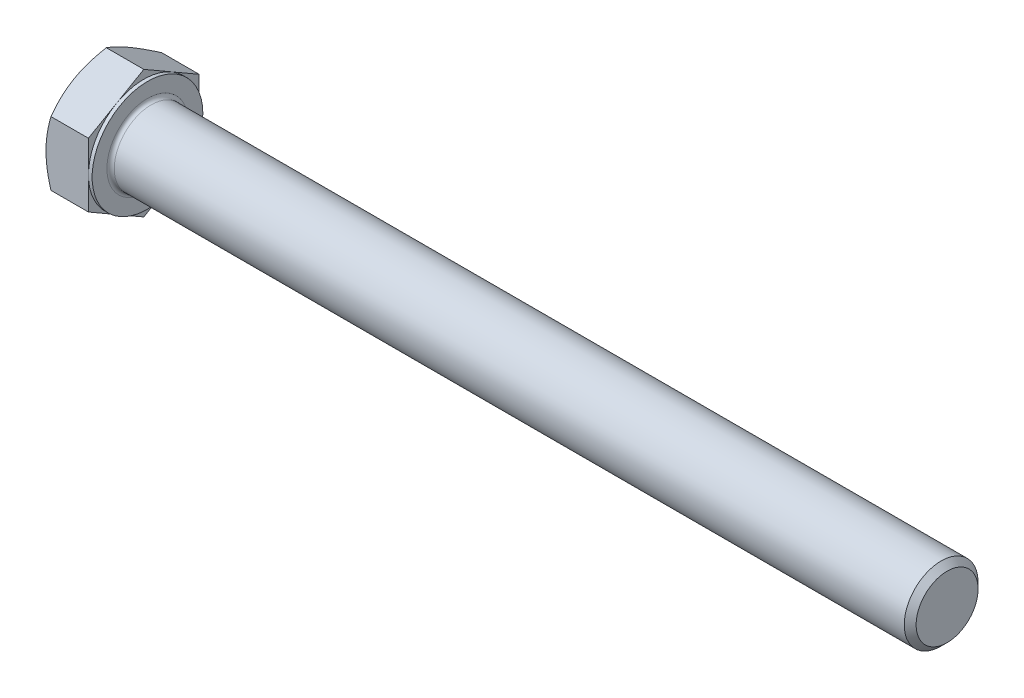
ISO-10303-21;
HEADER;
FILE_DESCRIPTION(('STEP AP214'),'2;1');
FILE_NAME('part.step','',(''),(''),'','','');
FILE_SCHEMA(('AUTOMOTIVE_DESIGN { 1 0 10303 214 1 1 1 1 }'));
ENDSEC;
DATA;
#1=APPLICATION_CONTEXT('core data for automotive mechanical design processes');
#2=APPLICATION_PROTOCOL_DEFINITION('international standard','automotive_design',2000,#1);
#3=PRODUCT_CONTEXT('',#1,'mechanical');
#4=PRODUCT('Part','Part','',(#3));
#5=PRODUCT_RELATED_PRODUCT_CATEGORY('part','',(#4));
#6=PRODUCT_DEFINITION_FORMATION('','',#4);
#7=PRODUCT_DEFINITION_CONTEXT('part definition',#1,'design');
#8=PRODUCT_DEFINITION('design','',#6,#7);
#9=PRODUCT_DEFINITION_SHAPE('','',#8);
#10=(LENGTH_UNIT() NAMED_UNIT(*) SI_UNIT(.MILLI.,.METRE.));
#11=(NAMED_UNIT(*) PLANE_ANGLE_UNIT() SI_UNIT($,.RADIAN.));
#12=(NAMED_UNIT(*) SI_UNIT($,.STERADIAN.) SOLID_ANGLE_UNIT());
#13=UNCERTAINTY_MEASURE_WITH_UNIT(LENGTH_MEASURE(1.E-05),#10,'distance_accuracy_value','');
#14=(GEOMETRIC_REPRESENTATION_CONTEXT(3) GLOBAL_UNCERTAINTY_ASSIGNED_CONTEXT((#13)) GLOBAL_UNIT_ASSIGNED_CONTEXT((#10,
#11,#12)) REPRESENTATION_CONTEXT('',''));
#15=CARTESIAN_POINT('',(0.,0.,0.));
#16=DIRECTION('',(0.,0.,1.));
#17=DIRECTION('',(1.,0.,0.));
#18=AXIS2_PLACEMENT_3D('',#15,#16,#17);
#19=CARTESIAN_POINT('',(7.5,0.,-18.));
#20=DIRECTION('',(1.,0.,0.));
#21=DIRECTION('',(0.,0.,-1.));
#22=AXIS2_PLACEMENT_3D('',#19,#20,#21);
#23=PLANE('',#22);
#24=CARTESIAN_POINT('',(7.5,0.,0.));
#25=DIRECTION('',(1.,0.,0.));
#26=DIRECTION('',(0.,0.,-1.));
#27=AXIS2_PLACEMENT_3D('',#24,#25,#26);
#28=CIRCLE('',#27,6.6);
#29=CARTESIAN_POINT('',(7.5,0.,-6.6));
#30=VERTEX_POINT('',#29);
#31=EDGE_CURVE('E42',#30,#30,#28,.F.);
#32=ORIENTED_EDGE('',*,*,#31,.T.);
#33=EDGE_LOOP('',(#32));
#34=FACE_BOUND('',#33,.T.);
#35=CARTESIAN_POINT('',(7.5,0.,0.));
#36=DIRECTION('',(1.,0.,0.));
#37=DIRECTION('',(0.,0.,-1.));
#38=AXIS2_PLACEMENT_3D('',#35,#36,#37);
#39=CIRCLE('',#38,9.);
#40=CARTESIAN_POINT('',(7.5,0.,-9.));
#41=VERTEX_POINT('',#40);
#42=EDGE_CURVE('E293',#41,#41,#39,.T.);
#43=ORIENTED_EDGE('',*,*,#42,.T.);
#44=EDGE_LOOP('',(#43));
#45=FACE_BOUND('',#44,.T.);
#46=ADVANCED_FACE('F34',(#34,#45),#23,.T.);
#47=CARTESIAN_POINT('',(0.,0.,0.));
#48=DIRECTION('',(-1.,0.,0.));
#49=DIRECTION('',(0.,0.,1.));
#50=AXIS2_PLACEMENT_3D('',#47,#48,#49);
#51=CYLINDRICAL_SURFACE('',#50,6.);
#52=CARTESIAN_POINT('',(8.1,0.,0.));
#53=DIRECTION('',(1.,0.,0.));
#54=DIRECTION('',(0.,0.,-1.));
#55=AXIS2_PLACEMENT_3D('',#52,#53,#54);
#56=CIRCLE('',#55,6.);
#57=CARTESIAN_POINT('',(8.1,0.,-6.));
#58=VERTEX_POINT('',#57);
#59=EDGE_CURVE('E11',#58,#58,#56,.T.);
#60=ORIENTED_EDGE('',*,*,#59,.T.);
#61=EDGE_LOOP('',(#60));
#62=FACE_BOUND('',#61,.T.);
#63=CARTESIAN_POINT('',(136.536,0.,0.));
#64=DIRECTION('',(-1.,0.,0.));
#65=DIRECTION('',(0.,0.,1.));
#66=AXIS2_PLACEMENT_3D('',#63,#64,#65);
#67=CIRCLE('',#66,6.);
#68=CARTESIAN_POINT('',(136.536,0.,6.));
#69=VERTEX_POINT('',#68);
#70=EDGE_CURVE('E272',#69,#69,#67,.T.);
#71=ORIENTED_EDGE('',*,*,#70,.T.);
#72=EDGE_LOOP('',(#71));
#73=FACE_BOUND('',#72,.T.);
#74=ADVANCED_FACE('F246',(#62,#73),#51,.T.);
#75=CARTESIAN_POINT('',(137.5,0.,0.));
#76=DIRECTION('',(-1.,0.,0.));
#77=DIRECTION('',(0.,0.,1.));
#78=AXIS2_PLACEMENT_3D('',#75,#76,#77);
#79=CONICAL_SURFACE('',#78,5.036,0.785398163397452);
#80=ORIENTED_EDGE('',*,*,#70,.F.);
#81=EDGE_LOOP('',(#80));
#82=FACE_BOUND('',#81,.T.);
#83=CARTESIAN_POINT('',(137.5,0.,0.));
#84=DIRECTION('',(-1.,0.,0.));
#85=DIRECTION('',(0.,0.,1.));
#86=AXIS2_PLACEMENT_3D('',#83,#84,#85);
#87=CIRCLE('',#86,5.036);
#88=CARTESIAN_POINT('',(137.5,0.,5.036));
#89=VERTEX_POINT('',#88);
#90=EDGE_CURVE('E270',#89,#89,#87,.T.);
#91=ORIENTED_EDGE('',*,*,#90,.T.);
#92=EDGE_LOOP('',(#91));
#93=FACE_BOUND('',#92,.T.);
#94=ADVANCED_FACE('F251',(#82,#93),#79,.T.);
#95=CARTESIAN_POINT('',(137.5,0.,0.));
#96=DIRECTION('',(-1.,0.,0.));
#97=DIRECTION('',(0.,0.,1.));
#98=AXIS2_PLACEMENT_3D('',#95,#96,#97);
#99=PLANE('',#98);
#100=ORIENTED_EDGE('',*,*,#90,.F.);
#101=EDGE_LOOP('',(#100));
#102=FACE_BOUND('',#101,.T.);
#103=ADVANCED_FACE('F258',(#102),#99,.F.);
#104=CARTESIAN_POINT('',(6.9,9.,0.));
#105=DIRECTION('',(1.,0.,0.));
#106=DIRECTION('',(0.,0.,-1.));
#107=AXIS2_PLACEMENT_3D('',#104,#105,#106);
#108=PLANE('',#107);
#109=DIRECTION('',(0.,0.500000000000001,0.866025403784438));
#110=VECTOR('',#109,1.);
#111=CARTESIAN_POINT('',(6.9,5.19615242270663,-9.));
#112=LINE('',#111,#110);
#113=CARTESIAN_POINT('',(6.9,5.19615242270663,-9.));
#114=VERTEX_POINT('',#113);
#115=CARTESIAN_POINT('',(6.9,7.79422863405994,-4.50000000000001));
#116=VERTEX_POINT('',#115);
#117=EDGE_CURVE('E166',#114,#116,#112,.T.);
#118=ORIENTED_EDGE('',*,*,#117,.T.);
#119=CARTESIAN_POINT('',(6.9,0.,0.));
#120=DIRECTION('',(-1.,0.,0.));
#121=DIRECTION('',(0.,0.,1.));
#122=AXIS2_PLACEMENT_3D('',#119,#120,#121);
#123=CIRCLE('',#122,9.);
#124=CARTESIAN_POINT('',(6.9,0.,-9.));
#125=VERTEX_POINT('',#124);
#126=EDGE_CURVE('E49',#116,#125,#123,.T.);
#127=ORIENTED_EDGE('',*,*,#126,.T.);
#128=DIRECTION('',(0.,1.,0.));
#129=VECTOR('',#128,1.);
#130=CARTESIAN_POINT('',(6.9,5.19615242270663,-9.));
#131=LINE('',#130,#129);
#132=EDGE_CURVE('E296',#125,#114,#131,.T.);
#133=ORIENTED_EDGE('',*,*,#132,.T.);
#134=EDGE_LOOP('',(#118,#127,#133));
#135=FACE_BOUND('',#134,.T.);
#136=ADVANCED_FACE('F261',(#135),#108,.T.);
#137=CARTESIAN_POINT('',(6.9,10.3923048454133,0.));
#138=VERTEX_POINT('',#137);
#139=EDGE_CURVE('E164',#116,#138,#112,.T.);
#140=ORIENTED_EDGE('',*,*,#139,.T.);
#141=DIRECTION('',(0.,-0.500000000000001,0.866025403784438));
#142=VECTOR('',#141,1.);
#143=CARTESIAN_POINT('',(6.9,10.3923048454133,0.));
#144=LINE('',#143,#142);
#145=CARTESIAN_POINT('',(6.9,7.79422863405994,4.50000000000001));
#146=VERTEX_POINT('',#145);
#147=EDGE_CURVE('E163',#138,#146,#144,.T.);
#148=ORIENTED_EDGE('',*,*,#147,.T.);
#149=EDGE_CURVE('E152',#146,#116,#123,.T.);
#150=ORIENTED_EDGE('',*,*,#149,.T.);
#151=EDGE_LOOP('',(#140,#148,#150));
#152=FACE_BOUND('',#151,.T.);
#153=ADVANCED_FACE('F266',(#152),#108,.T.);
#154=CARTESIAN_POINT('',(6.9,5.19615242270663,9.));
#155=VERTEX_POINT('',#154);
#156=EDGE_CURVE('E131',#146,#155,#144,.T.);
#157=ORIENTED_EDGE('',*,*,#156,.T.);
#158=DIRECTION('',(0.,-1.,0.));
#159=VECTOR('',#158,1.);
#160=CARTESIAN_POINT('',(6.9,5.19615242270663,9.));
#161=LINE('',#160,#159);
#162=CARTESIAN_POINT('',(6.9,0.,9.));
#163=VERTEX_POINT('',#162);
#164=EDGE_CURVE('E125',#155,#163,#161,.T.);
#165=ORIENTED_EDGE('',*,*,#164,.T.);
#166=EDGE_CURVE('E129',#163,#146,#123,.T.);
#167=ORIENTED_EDGE('',*,*,#166,.T.);
#168=EDGE_LOOP('',(#157,#165,#167));
#169=FACE_BOUND('',#168,.T.);
#170=ADVANCED_FACE('F127',(#169),#108,.T.);
#171=CARTESIAN_POINT('',(6.9,-5.19615242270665,9.));
#172=VERTEX_POINT('',#171);
#173=EDGE_CURVE('E135',#163,#172,#161,.T.);
#174=ORIENTED_EDGE('',*,*,#173,.T.);
#175=DIRECTION('',(0.,-0.500000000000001,-0.866025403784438));
#176=VECTOR('',#175,1.);
#177=CARTESIAN_POINT('',(6.9,-10.3923048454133,0.));
#178=LINE('',#177,#176);
#179=CARTESIAN_POINT('',(6.9,-7.79422863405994,4.50000000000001));
#180=VERTEX_POINT('',#179);
#181=EDGE_CURVE('E142',#172,#180,#178,.T.);
#182=ORIENTED_EDGE('',*,*,#181,.T.);
#183=EDGE_CURVE('E139',#180,#163,#123,.T.);
#184=ORIENTED_EDGE('',*,*,#183,.T.);
#185=EDGE_LOOP('',(#174,#182,#184));
#186=FACE_BOUND('',#185,.T.);
#187=ADVANCED_FACE('F140',(#186),#108,.T.);
#188=CARTESIAN_POINT('',(6.9,-10.3923048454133,0.));
#189=VERTEX_POINT('',#188);
#190=EDGE_CURVE('E158',#180,#189,#178,.T.);
#191=ORIENTED_EDGE('',*,*,#190,.T.);
#192=DIRECTION('',(0.,0.500000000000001,-0.866025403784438));
#193=VECTOR('',#192,1.);
#194=CARTESIAN_POINT('',(6.9,-5.19615242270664,-9.));
#195=LINE('',#194,#193);
#196=CARTESIAN_POINT('',(6.9,-7.79422863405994,-4.50000000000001));
#197=VERTEX_POINT('',#196);
#198=EDGE_CURVE('E334',#189,#197,#195,.T.);
#199=ORIENTED_EDGE('',*,*,#198,.T.);
#200=EDGE_CURVE('E146',#197,#180,#123,.T.);
#201=ORIENTED_EDGE('',*,*,#200,.T.);
#202=EDGE_LOOP('',(#191,#199,#201));
#203=FACE_BOUND('',#202,.T.);
#204=ADVANCED_FACE('F335',(#203),#108,.T.);
#205=CARTESIAN_POINT('',(6.9,-5.19615242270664,-9.));
#206=VERTEX_POINT('',#205);
#207=EDGE_CURVE('E153',#197,#206,#195,.T.);
#208=ORIENTED_EDGE('',*,*,#207,.T.);
#209=EDGE_CURVE('E297',#206,#125,#131,.T.);
#210=ORIENTED_EDGE('',*,*,#209,.T.);
#211=EDGE_CURVE('E304',#125,#197,#123,.T.);
#212=ORIENTED_EDGE('',*,*,#211,.T.);
#213=EDGE_LOOP('',(#208,#210,#212));
#214=FACE_BOUND('',#213,.T.);
#215=ADVANCED_FACE('F267',(#214),#108,.T.);
#216=CARTESIAN_POINT('',(0.,0.,0.));
#217=DIRECTION('',(-1.,0.,0.));
#218=DIRECTION('',(0.,0.,1.));
#219=AXIS2_PLACEMENT_3D('',#216,#217,#218);
#220=CYLINDRICAL_SURFACE('',#219,9.);
#221=ORIENTED_EDGE('',*,*,#126,.F.);
#222=ORIENTED_EDGE('',*,*,#149,.F.);
#223=ORIENTED_EDGE('',*,*,#166,.F.);
#224=ORIENTED_EDGE('',*,*,#183,.F.);
#225=ORIENTED_EDGE('',*,*,#200,.F.);
#226=ORIENTED_EDGE('',*,*,#211,.F.);
#227=EDGE_LOOP('',(#221,#222,#223,#224,#225,#226));
#228=FACE_BOUND('',#227,.T.);
#229=ORIENTED_EDGE('',*,*,#42,.F.);
#230=EDGE_LOOP('',(#229));
#231=FACE_BOUND('',#230,.T.);
#232=ADVANCED_FACE('F149',(#228,#231),#220,.T.);
#233=CARTESIAN_POINT('',(0.,0.,-18.));
#234=DIRECTION('',(1.,0.,0.));
#235=DIRECTION('',(0.,0.,-1.));
#236=AXIS2_PLACEMENT_3D('',#233,#234,#235);
#237=PLANE('',#236);
#238=CARTESIAN_POINT('',(0.,0.,0.));
#239=DIRECTION('',(1.,0.,0.));
#240=DIRECTION('',(0.,0.,-1.));
#241=AXIS2_PLACEMENT_3D('',#238,#239,#240);
#242=CIRCLE('',#241,9.);
#243=CARTESIAN_POINT('',(0.,0.,-9.));
#244=VERTEX_POINT('',#243);
#245=CARTESIAN_POINT('',(0.,7.79422863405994,-4.50000000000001));
#246=VERTEX_POINT('',#245);
#247=EDGE_CURVE('E292',#244,#246,#242,.T.);
#248=ORIENTED_EDGE('',*,*,#247,.F.);
#249=CARTESIAN_POINT('',(0.,-7.79422863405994,-4.50000000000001));
#250=VERTEX_POINT('',#249);
#251=EDGE_CURVE('E288',#250,#244,#242,.T.);
#252=ORIENTED_EDGE('',*,*,#251,.F.);
#253=CARTESIAN_POINT('',(0.,-7.79422863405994,4.50000000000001));
#254=VERTEX_POINT('',#253);
#255=EDGE_CURVE('E291',#254,#250,#242,.T.);
#256=ORIENTED_EDGE('',*,*,#255,.F.);
#257=CARTESIAN_POINT('',(0.,0.,9.));
#258=VERTEX_POINT('',#257);
#259=EDGE_CURVE('E327',#258,#254,#242,.T.);
#260=ORIENTED_EDGE('',*,*,#259,.F.);
#261=CARTESIAN_POINT('',(0.,0.,0.));
#262=DIRECTION('',(-1.,0.,0.));
#263=DIRECTION('',(0.,0.,1.));
#264=AXIS2_PLACEMENT_3D('',#261,#262,#263);
#265=CIRCLE('',#264,9.);
#266=CARTESIAN_POINT('',(0.,7.79422863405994,4.50000000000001));
#267=VERTEX_POINT('',#266);
#268=EDGE_CURVE('E167',#258,#267,#265,.T.);
#269=ORIENTED_EDGE('',*,*,#268,.T.);
#270=EDGE_CURVE('E350',#246,#267,#242,.T.);
#271=ORIENTED_EDGE('',*,*,#270,.F.);
#272=EDGE_LOOP('',(#248,#252,#256,#260,#269,#271));
#273=FACE_BOUND('',#272,.T.);
#274=ADVANCED_FACE('F196',(#273),#237,.F.);
#275=CARTESIAN_POINT('',(0.,0.,0.));
#276=DIRECTION('',(1.,0.,0.));
#277=DIRECTION('',(0.,0.,-1.));
#278=AXIS2_PLACEMENT_3D('',#275,#276,#277);
#279=CONICAL_SURFACE('',#278,9.,1.0471975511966);
#280=CARTESIAN_POINT('',(0.803914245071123,5.19603695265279,9.0002));
#281=CARTESIAN_POINT('',(0.737982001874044,5.31024090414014,8.80239295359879));
#282=CARTESIAN_POINT('',(0.675041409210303,5.42489028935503,8.60381439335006));
#283=CARTESIAN_POINT('',(0.555968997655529,5.65512011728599,8.20504463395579));
#284=CARTESIAN_POINT('',(0.499840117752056,5.77070093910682,8.00485277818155));
#285=CARTESIAN_POINT('',(0.395151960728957,6.00300811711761,7.60248494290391));
#286=CARTESIAN_POINT('',(0.346610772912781,6.11973652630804,7.40030540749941));
#287=CARTESIAN_POINT('',(0.258148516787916,6.35398725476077,6.99457124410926));
#288=CARTESIAN_POINT('',(0.218225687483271,6.47150940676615,6.7910169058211));
#289=CARTESIAN_POINT('',(0.148684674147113,6.70436794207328,6.38769409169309));
#290=CARTESIAN_POINT('',(0.118837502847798,6.81968712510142,6.187955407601));
#291=CARTESIAN_POINT('',(0.0687933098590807,7.05084147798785,5.78758432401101));
#292=CARTESIAN_POINT('',(0.04859543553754,7.16667660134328,5.5869520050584));
#293=CARTESIAN_POINT('',(0.0183543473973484,7.39854776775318,5.18533936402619));
#294=CARTESIAN_POINT('',(0.00829960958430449,7.51458343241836,4.98435969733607));
#295=CARTESIAN_POINT('',(-0.00143766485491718,7.74676155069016,4.58221540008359));
#296=CARTESIAN_POINT('',(-0.00112052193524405,7.86290400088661,4.38105077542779));
#297=CARTESIAN_POINT('',(0.00916395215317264,8.08003584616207,4.00496738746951));
#298=CARTESIAN_POINT('',(0.0178767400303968,8.18104055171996,3.83002210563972));
#299=CARTESIAN_POINT('',(0.0429773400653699,8.38281337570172,3.48054132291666));
#300=CARTESIAN_POINT('',(0.0593656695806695,8.4835814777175,3.30600585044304));
#301=CARTESIAN_POINT('',(0.11965655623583,8.7854956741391,2.7830751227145));
#302=CARTESIAN_POINT('',(0.174677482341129,8.98610736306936,2.43560548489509));
#303=CARTESIAN_POINT('',(0.312230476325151,9.38945876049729,1.73698037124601));
#304=CARTESIAN_POINT('',(0.395345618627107,9.59214699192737,1.38591405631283));
#305=CARTESIAN_POINT('',(0.583982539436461,9.99450087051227,0.689016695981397));
#306=CARTESIAN_POINT('',(0.689460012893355,10.1941716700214,0.343176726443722));
#307=CARTESIAN_POINT('',(0.803914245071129,10.3924203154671,-0.000200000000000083));
#308=B_SPLINE_CURVE_WITH_KNOTS('',3,(#280,#281,#282,#283,#284,#285,#286,#287,#288,#289,#290,
#291,#292,#293,#294,#295,#296,#297,#298,#299,#300,#301,#302,#303,#304,#305,#306,#307),
.UNSPECIFIED.,.F.,.F.,(4,2,2,2,2,2,2,2,2,2,2,2,2,4),(0.,0.713219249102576,1.42674513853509,
2.14194697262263,2.8570025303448,3.55449749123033,4.25193080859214,4.94857085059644,
5.64518936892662,6.25162976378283,6.8581110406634,8.07193747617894,9.31268391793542,
10.5509947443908),.UNSPECIFIED.);
#309=CARTESIAN_POINT('',(0.803847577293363,10.3923048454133,0.));
#310=VERTEX_POINT('',#309);
#311=EDGE_CURVE('E215',#267,#310,#308,.T.);
#312=ORIENTED_EDGE('',*,*,#311,.T.);
#313=CARTESIAN_POINT('',(0.803914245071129,10.3924203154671,0.000199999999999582));
#314=CARTESIAN_POINT('',(0.737982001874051,10.2782163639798,-0.197607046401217));
#315=CARTESIAN_POINT('',(0.67504140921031,10.1635669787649,-0.396185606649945));
#316=CARTESIAN_POINT('',(0.555968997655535,9.93333715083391,-0.794955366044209));
#317=CARTESIAN_POINT('',(0.499840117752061,9.81775632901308,-0.99514722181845));
#318=CARTESIAN_POINT('',(0.395151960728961,9.58544915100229,-1.3975150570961));
#319=CARTESIAN_POINT('',(0.346610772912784,9.46872074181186,-1.5996945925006));
#320=CARTESIAN_POINT('',(0.25814851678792,9.23447001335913,-2.00542875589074));
#321=CARTESIAN_POINT('',(0.218225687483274,9.11694786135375,-2.20898309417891));
#322=CARTESIAN_POINT('',(0.148684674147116,8.88408932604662,-2.61230590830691));
#323=CARTESIAN_POINT('',(0.118837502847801,8.76877014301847,-2.812044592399));
#324=CARTESIAN_POINT('',(0.0687933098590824,8.53761579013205,-3.21241567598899));
#325=CARTESIAN_POINT('',(0.0485954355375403,8.42178066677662,-3.4130479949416));
#326=CARTESIAN_POINT('',(0.0183543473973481,8.18990950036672,-3.81466063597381));
#327=CARTESIAN_POINT('',(0.0082996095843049,8.07387383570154,-4.01564030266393));
#328=CARTESIAN_POINT('',(-0.00143766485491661,7.84169571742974,-4.41778459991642));
#329=CARTESIAN_POINT('',(-0.00112052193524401,7.72555326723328,-4.61894922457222));
#330=CARTESIAN_POINT('',(0.00916395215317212,7.50842142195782,-4.9950326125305));
#331=CARTESIAN_POINT('',(0.0178767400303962,7.40741671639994,-5.16997789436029));
#332=CARTESIAN_POINT('',(0.0429773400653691,7.20564389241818,-5.51945867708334));
#333=CARTESIAN_POINT('',(0.0593656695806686,7.1048757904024,-5.69399414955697));
#334=CARTESIAN_POINT('',(0.119656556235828,6.8029615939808,-6.2169248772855));
#335=CARTESIAN_POINT('',(0.174677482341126,6.60234990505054,-6.56439451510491));
#336=CARTESIAN_POINT('',(0.312230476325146,6.19899850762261,-7.263019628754));
#337=CARTESIAN_POINT('',(0.395345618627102,5.99631027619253,-7.61408594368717));
#338=CARTESIAN_POINT('',(0.583982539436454,5.59395639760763,-8.3109833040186));
#339=CARTESIAN_POINT('',(0.689460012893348,5.39428559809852,-8.65682327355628));
#340=CARTESIAN_POINT('',(0.803914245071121,5.19603695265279,-9.0002));
#341=B_SPLINE_CURVE_WITH_KNOTS('',3,(#313,#314,#315,#316,#317,#318,#319,#320,#321,#322,#323,
#324,#325,#326,#327,#328,#329,#330,#331,#332,#333,#334,#335,#336,#337,#338,#339,#340),
.UNSPECIFIED.,.F.,.F.,(4,2,2,2,2,2,2,2,2,2,2,2,2,4),(0.,0.713219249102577,1.42674513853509,
2.14194697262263,2.8570025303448,3.55449749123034,4.25193080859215,4.94857085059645,
5.64518936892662,6.25162976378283,6.8581110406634,8.07193747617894,9.31268391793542,
10.5509947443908),.UNSPECIFIED.);
#342=EDGE_CURVE('E57',#310,#246,#341,.T.);
#343=ORIENTED_EDGE('',*,*,#342,.T.);
#344=ORIENTED_EDGE('',*,*,#270,.T.);
#345=EDGE_LOOP('',(#312,#343,#344));
#346=FACE_BOUND('',#345,.T.);
#347=ADVANCED_FACE('F351',(#346),#279,.T.);
#348=CARTESIAN_POINT('',(4.50308345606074,-14.1853984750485,9.00000000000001));
#349=CARTESIAN_POINT('',(4.31054430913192,-13.7903499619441,9.00000000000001));
#350=CARTESIAN_POINT('',(4.11978648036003,-13.3944187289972,9.00000000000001));
#351=CARTESIAN_POINT('',(3.74283091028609,-12.6003222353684,9.00000000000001));
#352=CARTESIAN_POINT('',(3.55663384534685,-12.2021566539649,9.00000000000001));
#353=CARTESIAN_POINT('',(3.18890856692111,-11.4011784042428,9.00000000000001));
#354=CARTESIAN_POINT('',(3.00740939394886,-10.998352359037,9.00000000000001));
#355=CARTESIAN_POINT('',(2.65153988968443,-10.1895752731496,9.00000000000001));
#356=CARTESIAN_POINT('',(2.47716923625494,-9.78362437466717,9.));
#357=CARTESIAN_POINT('',(2.13161245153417,-8.95398189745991,9.));
#358=CARTESIAN_POINT('',(1.96074001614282,-8.53015895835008,9.));
#359=CARTESIAN_POINT('',(1.63138410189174,-7.67764040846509,9.));
#360=CARTESIAN_POINT('',(1.47290198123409,-7.2489442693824,9.));
#361=CARTESIAN_POINT('',(1.17232155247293,-6.38672363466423,9.));
#362=CARTESIAN_POINT('',(1.0301919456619,-5.95321016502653,9.));
#363=CARTESIAN_POINT('',(0.766724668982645,-5.07998336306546,9.));
#364=CARTESIAN_POINT('',(0.645380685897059,-4.64027195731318,9.));
#365=CARTESIAN_POINT('',(0.429822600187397,-3.75682505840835,9.));
#366=CARTESIAN_POINT('',(0.335452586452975,-3.31312863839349,9.));
#367=CARTESIAN_POINT('',(0.218090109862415,-2.64336713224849,9.));
#368=CARTESIAN_POINT('',(0.182999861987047,-2.41939560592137,9.));
#369=CARTESIAN_POINT('',(0.121565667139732,-1.97026354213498,9.));
#370=CARTESIAN_POINT('',(0.0952208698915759,-1.74510312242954,9.));
#371=CARTESIAN_POINT('',(0.052145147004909,-1.29693480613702,9.));
#372=CARTESIAN_POINT('',(0.0352889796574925,-1.07393899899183,9.));
#373=CARTESIAN_POINT('',(0.0110310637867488,-0.627433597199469,9.));
#374=CARTESIAN_POINT('',(0.00362915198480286,-0.403924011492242,9.));
#375=CARTESIAN_POINT('',(-0.00154262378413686,0.0432079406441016,9.));
#376=CARTESIAN_POINT('',(0.000687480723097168,0.266830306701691,9.));
#377=CARTESIAN_POINT('',(0.01472260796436,0.713776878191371,9.));
#378=CARTESIAN_POINT('',(0.0265280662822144,0.937101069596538,9.));
#379=CARTESIAN_POINT('',(0.0656502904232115,1.46707212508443,9.));
#380=CARTESIAN_POINT('',(0.0971347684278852,1.77341845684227,9.));
#381=CARTESIAN_POINT('',(0.176454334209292,2.38397028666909,9.));
#382=CARTESIAN_POINT('',(0.224291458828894,2.68817551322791,9.));
#383=CARTESIAN_POINT('',(0.389806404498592,3.59715813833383,9.));
#384=CARTESIAN_POINT('',(0.529461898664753,4.19799413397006,9.));
#385=CARTESIAN_POINT('',(0.773331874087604,5.09670707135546,9.));
#386=CARTESIAN_POINT('',(0.861532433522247,5.39919911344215,9.));
#387=CARTESIAN_POINT('',(1.04752099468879,6.00125026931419,9.));
#388=CARTESIAN_POINT('',(1.14530906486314,6.30080936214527,9.));
#389=CARTESIAN_POINT('',(1.34886866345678,6.89708059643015,9.));
#390=CARTESIAN_POINT('',(1.45463788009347,7.19379353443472,9.));
#391=CARTESIAN_POINT('',(1.67287302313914,7.78473288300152,9.));
#392=CARTESIAN_POINT('',(1.78533883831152,8.07895933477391,9.));
#393=CARTESIAN_POINT('',(2.07523735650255,8.81619445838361,9.));
#394=CARTESIAN_POINT('',(2.25629467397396,9.25777585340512,9.));
#395=CARTESIAN_POINT('',(2.62827522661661,10.136777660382,9.));
#396=CARTESIAN_POINT('',(2.81919929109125,10.5741977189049,9.));
#397=CARTESIAN_POINT('',(3.20877963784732,11.445728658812,9.));
#398=CARTESIAN_POINT('',(3.40743823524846,11.8798385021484,9.));
#399=CARTESIAN_POINT('',(3.81079737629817,12.7452179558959,9.));
#400=CARTESIAN_POINT('',(4.01549773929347,13.1764876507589,9.));
#401=CARTESIAN_POINT('',(4.43000777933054,14.0372827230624,9.));
#402=CARTESIAN_POINT('',(4.63982402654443,14.4668049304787,9.));
#403=CARTESIAN_POINT('',(5.06336871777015,15.3239162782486,9.));
#404=CARTESIAN_POINT('',(5.27709718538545,15.7515054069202,9.));
#405=CARTESIAN_POINT('',(5.70771290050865,16.6049951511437,9.));
#406=CARTESIAN_POINT('',(5.9245995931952,17.0308960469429,9.));
#407=CARTESIAN_POINT('',(6.36101693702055,17.8813418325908,9.));
#408=CARTESIAN_POINT('',(6.58054759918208,18.3058867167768,9.));
#409=CARTESIAN_POINT('',(7.20096689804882,19.4981240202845,9.));
#410=CARTESIAN_POINT('',(7.60436223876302,20.2645118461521,9.));
#411=CARTESIAN_POINT('',(8.41646748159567,21.794506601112,9.));
#412=CARTESIAN_POINT('',(8.82517763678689,22.558113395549,9.));
#413=CARTESIAN_POINT('',(9.64538992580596,24.0808854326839,9.));
#414=CARTESIAN_POINT('',(10.0568800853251,24.8400571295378,9.));
#415=CARTESIAN_POINT('',(10.6764233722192,25.977523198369,9.));
#416=CARTESIAN_POINT('',(10.883315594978,26.3564507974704,9.));
#417=CARTESIAN_POINT('',(11.2977907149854,27.113927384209,9.));
#418=CARTESIAN_POINT('',(11.505373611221,27.4924763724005,9.));
#419=CARTESIAN_POINT('',(11.713260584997,27.8708583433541,9.));
#420=B_SPLINE_CURVE_WITH_KNOTS('',3,(#348,#349,#350,#351,#352,#353,#354,#355,#356,#357,#358,
#359,#360,#361,#362,#363,#364,#365,#366,#367,#368,#369,#370,#371,#372,#373,#374,#375,#376,#377,
#378,#379,#380,#381,#382,#383,#384,#385,#386,#387,#388,#389,#390,#391,#392,#393,#394,#395,#396,
#397,#398,#399,#400,#401,#402,#403,#404,#405,#406,#407,#408,#409,#410,#411,#412,#413,#414,#415,
#416,#417,#418,#419),.UNSPECIFIED.,.F.,.F.,(4,2,2,2,2,2,2,2,2,2,2,2,2,2,2,2,2,2,2,2,2,2,2,2,2,2,
2,2,2,2,2,2,2,2,2,4),(0.,1.3184276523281,2.63704965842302,3.96247407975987,5.28783853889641,
6.65860359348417,8.02951869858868,9.39776461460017,10.7655942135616,12.1253499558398,
12.8053173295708,13.4852185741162,14.1559216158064,14.8266130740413,15.497302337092,
16.1680221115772,17.0913849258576,18.0148627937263,19.8627426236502,20.8079230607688,
21.7531102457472,22.6980246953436,23.6429234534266,25.0745302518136,26.506257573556,
27.9384167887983,29.3705332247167,30.804597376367,32.2386701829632,33.6724940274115,
35.1063238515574,37.7045032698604,40.3028068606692,42.8933552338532,44.1885437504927,
45.4837303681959),.UNSPECIFIED.);
#421=CARTESIAN_POINT('',(0.803847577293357,5.19615242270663,9.));
#422=VERTEX_POINT('',#421);
#423=EDGE_CURVE('E227',#258,#422,#420,.T.);
#424=ORIENTED_EDGE('',*,*,#423,.T.);
#425=EDGE_CURVE('E226',#422,#267,#308,.T.);
#426=ORIENTED_EDGE('',*,*,#425,.T.);
#427=ORIENTED_EDGE('',*,*,#268,.F.);
#428=EDGE_LOOP('',(#424,#426,#427));
#429=FACE_BOUND('',#428,.T.);
#430=ADVANCED_FACE('F321',(#429),#279,.T.);
#431=CARTESIAN_POINT('',(0.803847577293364,-5.19615242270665,9.));
#432=VERTEX_POINT('',#431);
#433=EDGE_CURVE('E273',#432,#258,#420,.T.);
#434=ORIENTED_EDGE('',*,*,#433,.T.);
#435=ORIENTED_EDGE('',*,*,#259,.T.);
#436=CARTESIAN_POINT('',(0.803914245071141,-10.3924203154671,-0.000199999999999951));
#437=CARTESIAN_POINT('',(0.737982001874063,-10.2782163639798,0.197607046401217));
#438=CARTESIAN_POINT('',(0.675041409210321,-10.1635669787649,0.396185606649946));
#439=CARTESIAN_POINT('',(0.555968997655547,-9.93333715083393,0.794955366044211));
#440=CARTESIAN_POINT('',(0.499840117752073,-9.8177563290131,0.995147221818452));
#441=CARTESIAN_POINT('',(0.395151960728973,-9.58544915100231,1.3975150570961));
#442=CARTESIAN_POINT('',(0.346610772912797,-9.46872074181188,1.5996945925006));
#443=CARTESIAN_POINT('',(0.258148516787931,-9.23447001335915,2.00542875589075));
#444=CARTESIAN_POINT('',(0.218225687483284,-9.11694786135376,2.20898309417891));
#445=CARTESIAN_POINT('',(0.148684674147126,-8.88408932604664,2.61230590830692));
#446=CARTESIAN_POINT('',(0.118837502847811,-8.76877014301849,2.81204459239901));
#447=CARTESIAN_POINT('',(0.0687933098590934,-8.53761579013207,3.212415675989));
#448=CARTESIAN_POINT('',(0.0485954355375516,-8.42178066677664,3.41304799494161));
#449=CARTESIAN_POINT('',(0.0183543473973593,-8.18990950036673,3.81466063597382));
#450=CARTESIAN_POINT('',(0.00829960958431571,-8.07387383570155,4.01564030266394));
#451=CARTESIAN_POINT('',(-0.00143766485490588,-7.84169571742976,4.41778459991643));
#452=CARTESIAN_POINT('',(-0.00112052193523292,-7.7255532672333,4.61894922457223));
#453=CARTESIAN_POINT('',(0.00916395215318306,-7.50842142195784,4.99503261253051));
#454=CARTESIAN_POINT('',(0.0178767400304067,-7.40741671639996,5.1699778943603));
#455=CARTESIAN_POINT('',(0.0429773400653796,-7.2056438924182,5.51945867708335));
#456=CARTESIAN_POINT('',(0.0593656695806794,-7.10487579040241,5.69399414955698));
#457=CARTESIAN_POINT('',(0.119656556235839,-6.80296159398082,6.21692487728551));
#458=CARTESIAN_POINT('',(0.174677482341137,-6.60234990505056,6.56439451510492));
#459=CARTESIAN_POINT('',(0.312230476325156,-6.19899850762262,7.263019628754));
#460=CARTESIAN_POINT('',(0.395345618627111,-5.99631027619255,7.61408594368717));
#461=CARTESIAN_POINT('',(0.583982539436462,-5.59395639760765,8.31098330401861));
#462=CARTESIAN_POINT('',(0.689460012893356,-5.39428559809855,8.65682327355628));
#463=CARTESIAN_POINT('',(0.803914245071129,-5.19603695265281,9.0002));
#464=B_SPLINE_CURVE_WITH_KNOTS('',3,(#436,#437,#438,#439,#440,#441,#442,#443,#444,#445,#446,
#447,#448,#449,#450,#451,#452,#453,#454,#455,#456,#457,#458,#459,#460,#461,#462,#463),
.UNSPECIFIED.,.F.,.F.,(4,2,2,2,2,2,2,2,2,2,2,2,2,4),(0.,0.713219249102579,1.42674513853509,
2.14194697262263,2.85700253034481,3.55449749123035,4.25193080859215,4.94857085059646,
5.64518936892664,6.25162976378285,6.85811104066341,8.07193747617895,9.31268391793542,
10.5509947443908),.UNSPECIFIED.);
#465=EDGE_CURVE('E217',#254,#432,#464,.T.);
#466=ORIENTED_EDGE('',*,*,#465,.T.);
#467=EDGE_LOOP('',(#434,#435,#466));
#468=FACE_BOUND('',#467,.T.);
#469=ADVANCED_FACE('F185',(#468),#279,.T.);
#470=CARTESIAN_POINT('',(0.803847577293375,-10.3923048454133,0.));
#471=VERTEX_POINT('',#470);
#472=EDGE_CURVE('E210',#471,#254,#464,.T.);
#473=ORIENTED_EDGE('',*,*,#472,.T.);
#474=ORIENTED_EDGE('',*,*,#255,.T.);
#475=CARTESIAN_POINT('',(0.803914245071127,-5.19603695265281,-9.0002));
#476=CARTESIAN_POINT('',(0.737982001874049,-5.31024090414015,-8.80239295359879));
#477=CARTESIAN_POINT('',(0.675041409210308,-5.42489028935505,-8.60381439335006));
#478=CARTESIAN_POINT('',(0.555968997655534,-5.65512011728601,-8.20504463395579));
#479=CARTESIAN_POINT('',(0.49984011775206,-5.77070093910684,-8.00485277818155));
#480=CARTESIAN_POINT('',(0.395151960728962,-6.00300811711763,-7.6024849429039));
#481=CARTESIAN_POINT('',(0.346610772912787,-6.11973652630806,-7.40030540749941));
#482=CARTESIAN_POINT('',(0.258148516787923,-6.35398725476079,-6.99457124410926));
#483=CARTESIAN_POINT('',(0.218225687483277,-6.47150940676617,-6.79101690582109));
#484=CARTESIAN_POINT('',(0.148684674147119,-6.7043679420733,-6.38769409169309));
#485=CARTESIAN_POINT('',(0.118837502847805,-6.81968712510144,-6.187955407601));
#486=CARTESIAN_POINT('',(0.0687933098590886,-7.05084147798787,-5.78758432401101));
#487=CARTESIAN_POINT('',(0.0485954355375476,-7.1666766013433,-5.5869520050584));
#488=CARTESIAN_POINT('',(0.0183543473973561,-7.3985477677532,-5.18533936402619));
#489=CARTESIAN_POINT('',(0.0082996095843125,-7.51458343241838,-4.98435969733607));
#490=CARTESIAN_POINT('',(-0.00143766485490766,-7.74676155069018,-4.58221540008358));
#491=CARTESIAN_POINT('',(-0.00112052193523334,-7.86290400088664,-4.38105077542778));
#492=CARTESIAN_POINT('',(0.00916395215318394,-8.0800358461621,-4.0049673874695));
#493=CARTESIAN_POINT('',(0.0178767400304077,-8.18104055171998,-3.83002210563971));
#494=CARTESIAN_POINT('',(0.0429773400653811,-8.38281337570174,-3.48054132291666));
#495=CARTESIAN_POINT('',(0.0593656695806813,-8.48358147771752,-3.30600585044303));
#496=CARTESIAN_POINT('',(0.119656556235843,-8.78549567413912,-2.7830751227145));
#497=CARTESIAN_POINT('',(0.17467748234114,-8.98610736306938,-2.43560548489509));
#498=CARTESIAN_POINT('',(0.312230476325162,-9.38945876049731,-1.736980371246));
#499=CARTESIAN_POINT('',(0.395345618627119,-9.59214699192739,-1.38591405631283));
#500=CARTESIAN_POINT('',(0.583982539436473,-9.99450087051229,-0.689016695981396));
#501=CARTESIAN_POINT('',(0.689460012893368,-10.1941716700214,-0.343176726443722));
#502=CARTESIAN_POINT('',(0.803914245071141,-10.3924203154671,0.000200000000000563));
#503=B_SPLINE_CURVE_WITH_KNOTS('',3,(#475,#476,#477,#478,#479,#480,#481,#482,#483,#484,#485,
#486,#487,#488,#489,#490,#491,#492,#493,#494,#495,#496,#497,#498,#499,#500,#501,#502),
.UNSPECIFIED.,.F.,.F.,(4,2,2,2,2,2,2,2,2,2,2,2,2,4),(0.,0.713219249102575,1.42674513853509,
2.14194697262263,2.8570025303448,3.55449749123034,4.25193080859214,4.94857085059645,
5.64518936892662,6.25162976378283,6.8581110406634,8.07193747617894,9.31268391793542,
10.5509947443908),.UNSPECIFIED.);
#504=EDGE_CURVE('E216',#250,#471,#503,.T.);
#505=ORIENTED_EDGE('',*,*,#504,.T.);
#506=EDGE_LOOP('',(#473,#474,#505));
#507=FACE_BOUND('',#506,.T.);
#508=ADVANCED_FACE('F349',(#507),#279,.T.);
#509=CARTESIAN_POINT('',(0.803847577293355,5.19615242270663,-9.));
#510=VERTEX_POINT('',#509);
#511=EDGE_CURVE('E218',#246,#510,#341,.T.);
#512=ORIENTED_EDGE('',*,*,#511,.T.);
#513=CARTESIAN_POINT('',(4.50308345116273,-14.1853984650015,-9.));
#514=CARTESIAN_POINT('',(4.3105443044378,-13.7903499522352,-9.));
#515=CARTESIAN_POINT('',(4.1197864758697,-13.3944187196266,-9.));
#516=CARTESIAN_POINT('',(3.74283090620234,-12.6003222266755,-9.));
#517=CARTESIAN_POINT('',(3.55663384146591,-12.2021566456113,-9.));
#518=CARTESIAN_POINT('',(3.18890856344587,-11.4011783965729,-9.));
#519=CARTESIAN_POINT('',(3.00740939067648,-10.9983523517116,-9.));
#520=CARTESIAN_POINT('',(2.65153988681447,-10.1895752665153,-9.));
#521=CARTESIAN_POINT('',(2.47716923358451,-9.78362436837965,-9.));
#522=CARTESIAN_POINT('',(2.1316124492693,-8.95398189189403,-9.));
#523=CARTESIAN_POINT('',(1.96074001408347,-8.53015895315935,-9.));
#524=CARTESIAN_POINT('',(1.63138410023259,-7.67764040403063,-9.));
#525=CARTESIAN_POINT('',(1.47290197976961,-7.24894426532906,-9.));
#526=CARTESIAN_POINT('',(1.17232155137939,-6.38672363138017,-9.));
#527=CARTESIAN_POINT('',(1.0301919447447,-5.95321016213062,-9.));
#528=CARTESIAN_POINT('',(0.766724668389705,-5.07998336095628,-9.));
#529=CARTESIAN_POINT('',(0.645380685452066,-4.64027195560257,-9.));
#530=CARTESIAN_POINT('',(0.42982260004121,-3.756825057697,-9.));
#531=CARTESIAN_POINT('',(0.335452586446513,-3.3131286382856,-9.));
#532=CARTESIAN_POINT('',(0.218090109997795,-2.64336713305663,-9.));
#533=CARTESIAN_POINT('',(0.182999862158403,-2.41939560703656,-9.));
#534=CARTESIAN_POINT('',(0.121565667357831,-1.97026354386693,-9.));
#535=CARTESIAN_POINT('',(0.0952208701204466,-1.74510312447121,-9.));
#536=CARTESIAN_POINT('',(0.0521451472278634,-1.29693480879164,-9.));
#537=CARTESIAN_POINT('',(0.0352889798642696,-1.07393900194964,-9.));
#538=CARTESIAN_POINT('',(0.0110310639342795,-0.627433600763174,-9.));
#539=CARTESIAN_POINT('',(0.00362915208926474,-0.403924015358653,-9.));
#540=CARTESIAN_POINT('',(-0.001542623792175,0.0432079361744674,-9.));
#541=CARTESIAN_POINT('',(0.000687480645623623,0.266830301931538,-9.));
#542=CARTESIAN_POINT('',(0.014722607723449,0.71377687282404,-9.));
#543=CARTESIAN_POINT('',(0.0265280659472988,0.937101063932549,-9.));
#544=CARTESIAN_POINT('',(0.0656502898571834,1.46707211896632,-9.));
#545=CARTESIAN_POINT('',(0.0971347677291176,1.77341845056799,-9.));
#546=CARTESIAN_POINT('',(0.176454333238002,2.38397028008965,-9.));
#547=CARTESIAN_POINT('',(0.224291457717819,2.68817550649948,-9.));
#548=CARTESIAN_POINT('',(0.389806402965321,3.59715813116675,-9.));
#549=CARTESIAN_POINT('',(0.52946189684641,4.19799412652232,-9.));
#550=CARTESIAN_POINT('',(0.773331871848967,5.09670706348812,-9.));
#551=CARTESIAN_POINT('',(0.861532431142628,5.39919910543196,-9.));
#552=CARTESIAN_POINT('',(1.04752099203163,6.00125026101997,-9.));
#553=CARTESIAN_POINT('',(1.14530906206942,6.30080935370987,-9.));
#554=CARTESIAN_POINT('',(1.34886866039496,6.89708058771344,-9.));
#555=CARTESIAN_POINT('',(1.45463787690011,7.1937935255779,-9.));
#556=CARTESIAN_POINT('',(1.6728730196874,7.78473287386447,-9.));
#557=CARTESIAN_POINT('',(1.78533883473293,8.07895932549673,-9.));
#558=CARTESIAN_POINT('',(2.07523735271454,8.81619444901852,-9.));
#559=CARTESIAN_POINT('',(2.25629467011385,9.25777584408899,-9.));
#560=CARTESIAN_POINT('',(2.62827522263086,10.1367776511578,-9.));
#561=CARTESIAN_POINT('',(2.81919928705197,10.5741977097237,-9.));
#562=CARTESIAN_POINT('',(3.20877963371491,11.4457286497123,-9.));
#563=CARTESIAN_POINT('',(3.40743823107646,11.8798384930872,-9.));
#564=CARTESIAN_POINT('',(3.81079737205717,12.7452179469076,-9.));
#565=CARTESIAN_POINT('',(4.01549773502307,13.1764876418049,-9.));
#566=CARTESIAN_POINT('',(4.43000777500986,14.0372827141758,-9.));
#567=CARTESIAN_POINT('',(4.63982402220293,14.466804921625,-9.));
#568=CARTESIAN_POINT('',(5.06336871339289,15.3239162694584,-9.));
#569=CARTESIAN_POINT('',(5.27709718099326,15.7515053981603,-9.));
#570=CARTESIAN_POINT('',(5.707712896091,16.6049951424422,-9.));
#571=CARTESIAN_POINT('',(5.92459958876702,17.0308960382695,-9.));
#572=CARTESIAN_POINT('',(6.36101693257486,17.8813418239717,-9.));
#573=CARTESIAN_POINT('',(6.58054759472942,18.305886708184,-9.));
#574=CARTESIAN_POINT('',(7.20096689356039,19.4981240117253,-9.));
#575=CARTESIAN_POINT('',(7.60436223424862,20.2645118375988,-9.));
#576=CARTESIAN_POINT('',(8.41646747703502,21.7945065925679,-9.));
#577=CARTESIAN_POINT('',(8.82517763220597,22.558113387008,-9.));
#578=CARTESIAN_POINT('',(9.64538992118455,24.0808854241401,-9.));
#579=CARTESIAN_POINT('',(10.0568800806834,24.8400571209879,-9.));
#580=CARTESIAN_POINT('',(10.6764233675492,25.9775231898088,-9.));
#581=CARTESIAN_POINT('',(10.8833155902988,26.3564507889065,-9.));
#582=CARTESIAN_POINT('',(11.2977907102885,27.1139273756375,-9.));
#583=CARTESIAN_POINT('',(11.5053736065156,27.492476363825,-9.));
#584=CARTESIAN_POINT('',(11.7132605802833,27.8708583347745,-9.));
#585=B_SPLINE_CURVE_WITH_KNOTS('',3,(#513,#514,#515,#516,#517,#518,#519,#520,#521,#522,#523,
#524,#525,#526,#527,#528,#529,#530,#531,#532,#533,#534,#535,#536,#537,#538,#539,#540,#541,#542,
#543,#544,#545,#546,#547,#548,#549,#550,#551,#552,#553,#554,#555,#556,#557,#558,#559,#560,#561,
#562,#563,#564,#565,#566,#567,#568,#569,#570,#571,#572,#573,#574,#575,#576,#577,#578,#579,#580,
#581,#582,#583,#584),.UNSPECIFIED.,.F.,.F.,(4,2,2,2,2,2,2,2,2,2,2,2,2,2,2,2,2,2,2,2,2,2,2,2,2,2,
2,2,2,2,2,2,2,2,2,4),(0.,1.31842765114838,2.6370496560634,3.96247407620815,5.28783853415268,
6.65860358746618,8.02951869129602,9.39776460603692,10.7655942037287,12.1253499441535,
12.8053173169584,13.4852185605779,14.1559216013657,14.8266130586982,15.4973023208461,
16.1680220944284,17.0913849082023,18.0148627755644,19.862742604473,20.8079230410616,
21.7531102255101,22.6980246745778,23.6429234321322,25.0745302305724,26.5062575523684,
27.9384167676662,29.3705332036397,30.8045973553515,32.2386701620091,33.6724940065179,
35.1063238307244,37.7045032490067,40.3028068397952,42.8933552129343,44.1885437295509,
45.4837303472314),.UNSPECIFIED.);
#586=EDGE_CURVE('E178',#510,#244,#585,.F.);
#587=ORIENTED_EDGE('',*,*,#586,.T.);
#588=ORIENTED_EDGE('',*,*,#247,.T.);
#589=EDGE_LOOP('',(#512,#587,#588));
#590=FACE_BOUND('',#589,.T.);
#591=ADVANCED_FACE('F346',(#590),#279,.T.);
#592=CARTESIAN_POINT('',(0.803847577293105,-5.19615242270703,-9.));
#593=VERTEX_POINT('',#592);
#594=EDGE_CURVE('E179',#593,#250,#503,.T.);
#595=ORIENTED_EDGE('',*,*,#594,.T.);
#596=ORIENTED_EDGE('',*,*,#251,.T.);
#597=EDGE_CURVE('E170',#244,#593,#585,.F.);
#598=ORIENTED_EDGE('',*,*,#597,.T.);
#599=EDGE_LOOP('',(#595,#596,#598));
#600=FACE_BOUND('',#599,.T.);
#601=ADVANCED_FACE('F194',(#600),#279,.T.);
#602=CARTESIAN_POINT('',(7.5,5.19615242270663,-9.));
#603=DIRECTION('',(0.,0.,1.));
#604=DIRECTION('',(1.,0.,0.));
#605=AXIS2_PLACEMENT_3D('',#602,#603,#604);
#606=PLANE('',#605);
#607=ORIENTED_EDGE('',*,*,#209,.F.);
#608=DIRECTION('',(-1.,0.,0.));
#609=VECTOR('',#608,1.);
#610=CARTESIAN_POINT('',(7.5,-5.19615242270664,-9.));
#611=LINE('',#610,#609);
#612=EDGE_CURVE('E279',#206,#593,#611,.T.);
#613=ORIENTED_EDGE('',*,*,#612,.T.);
#614=ORIENTED_EDGE('',*,*,#597,.F.);
#615=ORIENTED_EDGE('',*,*,#586,.F.);
#616=DIRECTION('',(-1.,0.,0.));
#617=VECTOR('',#616,1.);
#618=CARTESIAN_POINT('',(7.5,5.19615242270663,-9.));
#619=LINE('',#618,#617);
#620=EDGE_CURVE('E275',#114,#510,#619,.T.);
#621=ORIENTED_EDGE('',*,*,#620,.F.);
#622=ORIENTED_EDGE('',*,*,#132,.F.);
#623=EDGE_LOOP('',(#607,#613,#614,#615,#621,#622));
#624=FACE_BOUND('',#623,.T.);
#625=ADVANCED_FACE('F189',(#624),#606,.F.);
#626=CARTESIAN_POINT('',(7.5,-5.19615242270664,-9.));
#627=DIRECTION('',(0.,0.866025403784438,0.500000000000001));
#628=DIRECTION('',(0.,-0.500000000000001,0.866025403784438));
#629=AXIS2_PLACEMENT_3D('',#626,#627,#628);
#630=PLANE('',#629);
#631=ORIENTED_EDGE('',*,*,#198,.F.);
#632=DIRECTION('',(-1.,0.,0.));
#633=VECTOR('',#632,1.);
#634=CARTESIAN_POINT('',(7.5,-10.3923048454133,0.));
#635=LINE('',#634,#633);
#636=EDGE_CURVE('E281',#189,#471,#635,.T.);
#637=ORIENTED_EDGE('',*,*,#636,.T.);
#638=ORIENTED_EDGE('',*,*,#504,.F.);
#639=ORIENTED_EDGE('',*,*,#594,.F.);
#640=ORIENTED_EDGE('',*,*,#612,.F.);
#641=ORIENTED_EDGE('',*,*,#207,.F.);
#642=EDGE_LOOP('',(#631,#637,#638,#639,#640,#641));
#643=FACE_BOUND('',#642,.T.);
#644=ADVANCED_FACE('F193',(#643),#630,.F.);
#645=CARTESIAN_POINT('',(7.5,-10.3923048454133,0.));
#646=DIRECTION('',(0.,0.866025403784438,-0.500000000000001));
#647=DIRECTION('',(0.,0.500000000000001,0.866025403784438));
#648=AXIS2_PLACEMENT_3D('',#645,#646,#647);
#649=PLANE('',#648);
#650=ORIENTED_EDGE('',*,*,#181,.F.);
#651=DIRECTION('',(-1.,0.,0.));
#652=VECTOR('',#651,1.);
#653=CARTESIAN_POINT('',(7.5,-5.19615242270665,9.));
#654=LINE('',#653,#652);
#655=EDGE_CURVE('E157',#172,#432,#654,.T.);
#656=ORIENTED_EDGE('',*,*,#655,.T.);
#657=ORIENTED_EDGE('',*,*,#465,.F.);
#658=ORIENTED_EDGE('',*,*,#472,.F.);
#659=ORIENTED_EDGE('',*,*,#636,.F.);
#660=ORIENTED_EDGE('',*,*,#190,.F.);
#661=EDGE_LOOP('',(#650,#656,#657,#658,#659,#660));
#662=FACE_BOUND('',#661,.T.);
#663=ADVANCED_FACE('F201',(#662),#649,.F.);
#664=CARTESIAN_POINT('',(7.5,5.19615242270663,9.));
#665=DIRECTION('',(0.,0.,-1.));
#666=DIRECTION('',(0.,1.,0.));
#667=AXIS2_PLACEMENT_3D('',#664,#665,#666);
#668=PLANE('',#667);
#669=ORIENTED_EDGE('',*,*,#164,.F.);
#670=DIRECTION('',(-1.,0.,0.));
#671=VECTOR('',#670,1.);
#672=CARTESIAN_POINT('',(7.5,5.19615242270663,9.));
#673=LINE('',#672,#671);
#674=EDGE_CURVE('E284',#155,#422,#673,.T.);
#675=ORIENTED_EDGE('',*,*,#674,.T.);
#676=ORIENTED_EDGE('',*,*,#423,.F.);
#677=ORIENTED_EDGE('',*,*,#433,.F.);
#678=ORIENTED_EDGE('',*,*,#655,.F.);
#679=ORIENTED_EDGE('',*,*,#173,.F.);
#680=EDGE_LOOP('',(#669,#675,#676,#677,#678,#679));
#681=FACE_BOUND('',#680,.T.);
#682=ADVANCED_FACE('F155',(#681),#668,.F.);
#683=CARTESIAN_POINT('',(7.5,10.3923048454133,0.));
#684=DIRECTION('',(0.,-0.866025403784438,-0.500000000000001));
#685=DIRECTION('',(0.,0.500000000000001,-0.866025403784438));
#686=AXIS2_PLACEMENT_3D('',#683,#684,#685);
#687=PLANE('',#686);
#688=ORIENTED_EDGE('',*,*,#147,.F.);
#689=DIRECTION('',(-1.,0.,0.));
#690=VECTOR('',#689,1.);
#691=CARTESIAN_POINT('',(7.5,10.3923048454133,0.));
#692=LINE('',#691,#690);
#693=EDGE_CURVE('E286',#138,#310,#692,.T.);
#694=ORIENTED_EDGE('',*,*,#693,.T.);
#695=ORIENTED_EDGE('',*,*,#311,.F.);
#696=ORIENTED_EDGE('',*,*,#425,.F.);
#697=ORIENTED_EDGE('',*,*,#674,.F.);
#698=ORIENTED_EDGE('',*,*,#156,.F.);
#699=EDGE_LOOP('',(#688,#694,#695,#696,#697,#698));
#700=FACE_BOUND('',#699,.T.);
#701=ADVANCED_FACE('F232',(#700),#687,.F.);
#702=CARTESIAN_POINT('',(7.5,5.19615242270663,-9.));
#703=DIRECTION('',(0.,-0.866025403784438,0.500000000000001));
#704=DIRECTION('',(0.,-0.500000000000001,-0.866025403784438));
#705=AXIS2_PLACEMENT_3D('',#702,#703,#704);
#706=PLANE('',#705);
#707=ORIENTED_EDGE('',*,*,#117,.F.);
#708=ORIENTED_EDGE('',*,*,#620,.T.);
#709=ORIENTED_EDGE('',*,*,#511,.F.);
#710=ORIENTED_EDGE('',*,*,#342,.F.);
#711=ORIENTED_EDGE('',*,*,#693,.F.);
#712=ORIENTED_EDGE('',*,*,#139,.F.);
#713=EDGE_LOOP('',(#707,#708,#709,#710,#711,#712));
#714=FACE_BOUND('',#713,.T.);
#715=ADVANCED_FACE('F235',(#714),#706,.F.);
#716=CARTESIAN_POINT('',(8.1,0.,0.));
#717=DIRECTION('',(1.,0.,0.));
#718=DIRECTION('',(0.,0.,-1.));
#719=AXIS2_PLACEMENT_3D('',#716,#717,#718);
#720=TOROIDAL_SURFACE('',#719,6.6,0.6);
#721=ORIENTED_EDGE('',*,*,#59,.F.);
#722=EDGE_LOOP('',(#721));
#723=FACE_BOUND('',#722,.T.);
#724=ORIENTED_EDGE('',*,*,#31,.F.);
#725=EDGE_LOOP('',(#724));
#726=FACE_BOUND('',#725,.T.);
#727=ADVANCED_FACE('F36',(#723,#726),#720,.F.);
#728=CLOSED_SHELL('',(#46,#74,#94,#103,#136,#153,#170,#187,#204,#215,#232,#274,#347,#430,#469,
#508,#591,#601,#625,#644,#663,#682,#701,#715,#727));
#729=MANIFOLD_SOLID_BREP('B2',#728);
#730=ADVANCED_BREP_SHAPE_REPRESENTATION('',(#18,#729),#14);
#731=SHAPE_DEFINITION_REPRESENTATION(#9,#730);
ENDSEC;
END-ISO-10303-21;
